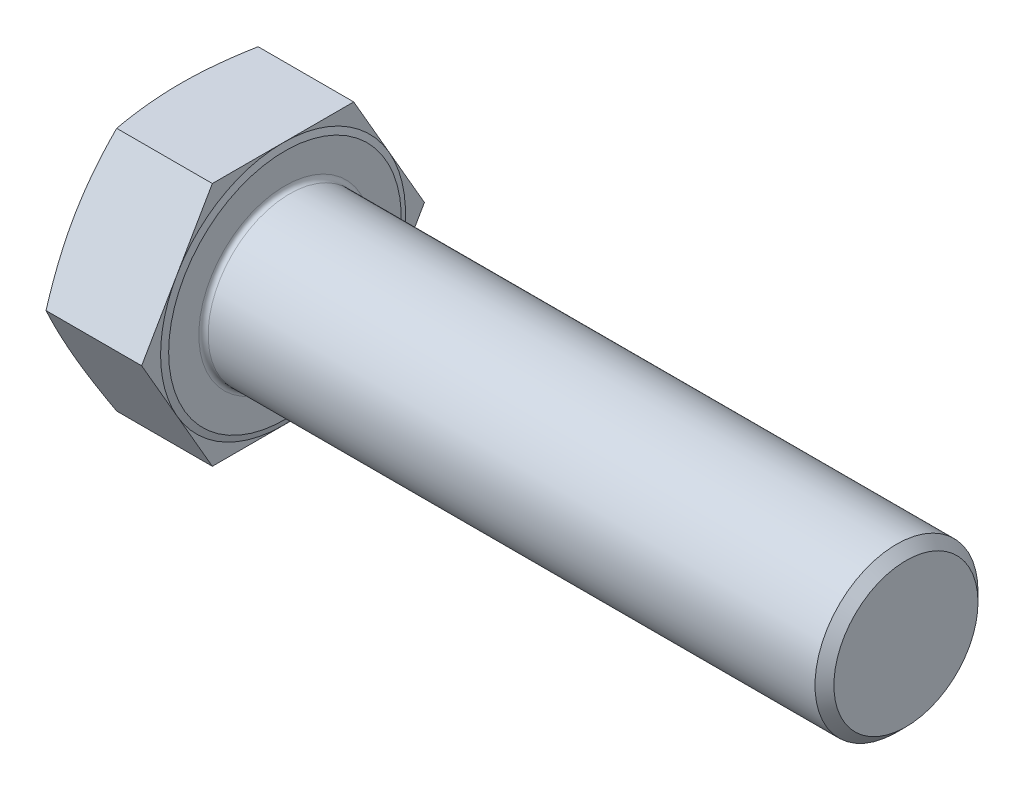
from build123d import *

# Parameters (mm, degrees)
BASEHEAD_DEPTH = 26.42
SKETCH3_R      = 21
BASEBODY_DEPTH = 160
HEADFILLET_R   = 1.2
CHAMFER1_SIZE  = 2.4355


with BuildPart() as part:
    # Sketch-BaseHead → BaseHead (new body)
    with BuildSketch(Plane(origin=(0, 0, 0), x_dir=(0, 0, -1), z_dir=(1, 0, 0))):
        Polygon((36.430801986, 0), (18.215400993, 31.55), (-18.215400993, 31.55), (-36.430801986, 0), (-18.215400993, -31.55), (18.215400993, -31.55), align=None)
    extrude(amount=BASEHEAD_DEPTH)

    # Sketch4 → HeadChamfer (revolve, cut)
    with BuildSketch(Plane(origin=(-0.264637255, 0, 5.916896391), x_dir=(0, 0, -1), z_dir=(0, 1, 0))):
        Polygon((42.347698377, -0.264637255), (37.466896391, -0.264637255), (42.347698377, -2.041103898), align=None)
    revolve(axis=Axis((-4.001564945, 0, 0), (1, 0, 0)), mode=Mode.SUBTRACT)

    # Sketch1 → Revolve1 (revolve)
    with BuildSketch(Plane.XY, mode=Mode.PRIVATE) as revolve1_sk:
        Polygon((26.42, 0), (26.92, 0), (26.92, -29.975), (26.42, -31.55), align=None)
    revolve(revolve1_sk.sketch.rotate(Axis((-4.001564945, 0, 0), (1, 0, 0)), 270), axis=Axis((-4.001564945, 0, 0), (1, 0, 0)))

    # Sketch3 → BaseBody (add)
    with BuildSketch(Plane(origin=(26.92, 0, 0), x_dir=(0, 0, -1), z_dir=(1, 0, 0))):
        Circle(SKETCH3_R)
    extrude(amount=BASEBODY_DEPTH)

    # HeadFillet
    headfillet_edges = [part.edges().sort_by_distance(p)[0] for p in [
        (26.92, 0, 21),
    ]]
    fillet(headfillet_edges, radius=HEADFILLET_R)

    # Chamfer1
    chamfer1_edges = [part.edges().sort_by_distance(p)[0] for p in [
        (186.92, 0, 21),
    ]]
    chamfer(chamfer1_edges, length=CHAMFER1_SIZE)


solid = part.part
